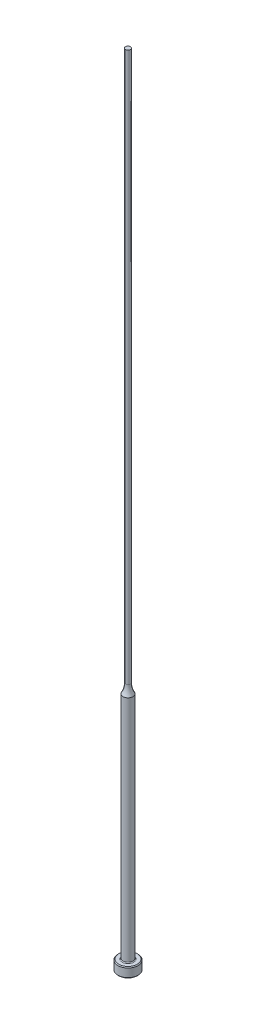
ISO-10303-21;
HEADER;
FILE_DESCRIPTION(('STEP AP214'),'2;1');
FILE_NAME('part.step','',(''),(''),'','','');
FILE_SCHEMA(('AUTOMOTIVE_DESIGN { 1 0 10303 214 1 1 1 1 }'));
ENDSEC;
DATA;
#1=APPLICATION_CONTEXT('core data for automotive mechanical design processes');
#2=APPLICATION_PROTOCOL_DEFINITION('international standard','automotive_design',2000,#1);
#3=PRODUCT_CONTEXT('',#1,'mechanical');
#4=PRODUCT('Part','Part','',(#3));
#5=PRODUCT_RELATED_PRODUCT_CATEGORY('part','',(#4));
#6=PRODUCT_DEFINITION_FORMATION('','',#4);
#7=PRODUCT_DEFINITION_CONTEXT('part definition',#1,'design');
#8=PRODUCT_DEFINITION('design','',#6,#7);
#9=PRODUCT_DEFINITION_SHAPE('','',#8);
#10=(LENGTH_UNIT() NAMED_UNIT(*) SI_UNIT(.MILLI.,.METRE.));
#11=(NAMED_UNIT(*) PLANE_ANGLE_UNIT() SI_UNIT($,.RADIAN.));
#12=(NAMED_UNIT(*) SI_UNIT($,.STERADIAN.) SOLID_ANGLE_UNIT());
#13=UNCERTAINTY_MEASURE_WITH_UNIT(LENGTH_MEASURE(1.E-05),#10,'distance_accuracy_value','');
#14=(GEOMETRIC_REPRESENTATION_CONTEXT(3) GLOBAL_UNCERTAINTY_ASSIGNED_CONTEXT((#13)) GLOBAL_UNIT_ASSIGNED_CONTEXT((#10,
#11,#12)) REPRESENTATION_CONTEXT('',''));
#15=CARTESIAN_POINT('',(0.,0.,0.));
#16=DIRECTION('',(0.,0.,1.));
#17=DIRECTION('',(1.,0.,0.));
#18=AXIS2_PLACEMENT_3D('',#15,#16,#17);
#19=CARTESIAN_POINT('',(-0.793749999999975,254.,0.));
#20=DIRECTION('',(0.,1.,0.));
#21=DIRECTION('',(0.,0.,1.));
#22=AXIS2_PLACEMENT_3D('',#19,#20,#21);
#23=PLANE('',#22);
#24=CARTESIAN_POINT('',(0.,254.,0.));
#25=DIRECTION('',(0.,1.,0.));
#26=DIRECTION('',(0.,0.,1.));
#27=AXIS2_PLACEMENT_3D('',#24,#25,#26);
#28=CIRCLE('',#27,0.793749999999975);
#29=CARTESIAN_POINT('',(0.,254.,0.793749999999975));
#30=VERTEX_POINT('',#29);
#31=EDGE_CURVE('E61',#30,#30,#28,.T.);
#32=ORIENTED_EDGE('',*,*,#31,.T.);
#33=EDGE_LOOP('',(#32));
#34=FACE_BOUND('',#33,.T.);
#35=ADVANCED_FACE('F35',(#34),#23,.T.);
#36=CARTESIAN_POINT('',(0.,259.958771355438,0.));
#37=DIRECTION('',(0.,1.,0.));
#38=DIRECTION('',(0.,0.,1.));
#39=AXIS2_PLACEMENT_3D('',#36,#37,#38);
#40=CYLINDRICAL_SURFACE('',#39,0.793749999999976);
#41=CARTESIAN_POINT('',(0.,79.2741805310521,0.));
#42=DIRECTION('',(0.,1.,0.));
#43=DIRECTION('',(0.,0.,1.));
#44=AXIS2_PLACEMENT_3D('',#41,#42,#43);
#45=CIRCLE('',#44,0.793749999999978);
#46=CARTESIAN_POINT('',(0.,79.2741805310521,0.793749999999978));
#47=VERTEX_POINT('',#46);
#48=EDGE_CURVE('E64',#47,#47,#45,.T.);
#49=ORIENTED_EDGE('',*,*,#48,.T.);
#50=EDGE_LOOP('',(#49));
#51=FACE_BOUND('',#50,.T.);
#52=ORIENTED_EDGE('',*,*,#31,.F.);
#53=EDGE_LOOP('',(#52));
#54=FACE_BOUND('',#53,.T.);
#55=ADVANCED_FACE('F84',(#51,#54),#40,.T.);
#56=CARTESIAN_POINT('',(0.,79.2741805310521,0.));
#57=DIRECTION('',(0.,1.,0.));
#58=DIRECTION('',(0.,0.,1.));
#59=AXIS2_PLACEMENT_3D('',#56,#57,#58);
#60=TOROIDAL_SURFACE('',#59,7.14374999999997,6.35);
#61=CARTESIAN_POINT('',(0.,76.2,0.));
#62=DIRECTION('',(0.,1.,0.));
#63=DIRECTION('',(0.,0.,1.));
#64=AXIS2_PLACEMENT_3D('',#61,#62,#63);
#65=CIRCLE('',#64,1.58749999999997);
#66=CARTESIAN_POINT('',(0.,76.2,1.58749999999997));
#67=VERTEX_POINT('',#66);
#68=EDGE_CURVE('E67',#67,#67,#65,.T.);
#69=ORIENTED_EDGE('',*,*,#68,.T.);
#70=EDGE_LOOP('',(#69));
#71=FACE_BOUND('',#70,.T.);
#72=ORIENTED_EDGE('',*,*,#48,.F.);
#73=EDGE_LOOP('',(#72));
#74=FACE_BOUND('',#73,.T.);
#75=ADVANCED_FACE('F71',(#71,#74),#60,.F.);
#76=CARTESIAN_POINT('',(0.,259.958771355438,0.));
#77=DIRECTION('',(0.,1.,0.));
#78=DIRECTION('',(0.,0.,1.));
#79=AXIS2_PLACEMENT_3D('',#76,#77,#78);
#80=CYLINDRICAL_SURFACE('',#79,1.58749999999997);
#81=CARTESIAN_POINT('',(0.,3.42900000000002,0.));
#82=DIRECTION('',(0.,1.,0.));
#83=DIRECTION('',(0.,0.,1.));
#84=AXIS2_PLACEMENT_3D('',#81,#82,#83);
#85=CIRCLE('',#84,1.58749999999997);
#86=CARTESIAN_POINT('',(0.,3.42900000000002,1.58749999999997));
#87=VERTEX_POINT('',#86);
#88=EDGE_CURVE('E42',#87,#87,#85,.T.);
#89=ORIENTED_EDGE('',*,*,#88,.T.);
#90=EDGE_LOOP('',(#89));
#91=FACE_BOUND('',#90,.T.);
#92=ORIENTED_EDGE('',*,*,#68,.F.);
#93=EDGE_LOOP('',(#92));
#94=FACE_BOUND('',#93,.T.);
#95=ADVANCED_FACE('F74',(#91,#94),#80,.T.);
#96=CARTESIAN_POINT('',(-3.17499999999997,3.175,0.));
#97=DIRECTION('',(0.,1.,0.));
#98=DIRECTION('',(0.,0.,1.));
#99=AXIS2_PLACEMENT_3D('',#96,#97,#98);
#100=PLANE('',#99);
#101=CARTESIAN_POINT('',(0.,3.175,0.));
#102=DIRECTION('',(0.,1.,0.));
#103=DIRECTION('',(0.,0.,1.));
#104=AXIS2_PLACEMENT_3D('',#101,#102,#103);
#105=CIRCLE('',#104,1.84149999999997);
#106=CARTESIAN_POINT('',(0.,3.175,1.84149999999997));
#107=VERTEX_POINT('',#106);
#108=EDGE_CURVE('E10',#107,#107,#105,.F.);
#109=ORIENTED_EDGE('',*,*,#108,.T.);
#110=EDGE_LOOP('',(#109));
#111=FACE_BOUND('',#110,.T.);
#112=CARTESIAN_POINT('',(0.,3.175,0.));
#113=DIRECTION('',(0.,1.,0.));
#114=DIRECTION('',(0.,0.,1.));
#115=AXIS2_PLACEMENT_3D('',#112,#113,#114);
#116=CIRCLE('',#115,2.92099999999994);
#117=CARTESIAN_POINT('',(0.,3.175,2.92099999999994));
#118=VERTEX_POINT('',#117);
#119=EDGE_CURVE('E58',#118,#118,#116,.T.);
#120=ORIENTED_EDGE('',*,*,#119,.T.);
#121=EDGE_LOOP('',(#120));
#122=FACE_BOUND('',#121,.T.);
#123=ADVANCED_FACE('F76',(#111,#122),#100,.T.);
#124=CARTESIAN_POINT('',(0.,259.958771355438,0.));
#125=DIRECTION('',(0.,1.,0.));
#126=DIRECTION('',(0.,0.,1.));
#127=AXIS2_PLACEMENT_3D('',#124,#125,#126);
#128=CYLINDRICAL_SURFACE('',#127,3.17499999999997);
#129=CARTESIAN_POINT('',(0.,2.92100000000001,0.));
#130=DIRECTION('',(0.,1.,0.));
#131=DIRECTION('',(0.,0.,1.));
#132=AXIS2_PLACEMENT_3D('',#129,#130,#131);
#133=CIRCLE('',#132,3.17499999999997);
#134=CARTESIAN_POINT('',(0.,2.92100000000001,3.17499999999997));
#135=VERTEX_POINT('',#134);
#136=EDGE_CURVE('E50',#135,#135,#133,.F.);
#137=ORIENTED_EDGE('',*,*,#136,.T.);
#138=EDGE_LOOP('',(#137));
#139=FACE_BOUND('',#138,.T.);
#140=CARTESIAN_POINT('',(0.,0.253999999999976,0.));
#141=DIRECTION('',(0.,-1.,0.));
#142=DIRECTION('',(0.,0.,-1.));
#143=AXIS2_PLACEMENT_3D('',#140,#141,#142);
#144=CIRCLE('',#143,3.17499999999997);
#145=CARTESIAN_POINT('',(0.,0.253999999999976,-3.17499999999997));
#146=VERTEX_POINT('',#145);
#147=EDGE_CURVE('E55',#146,#146,#144,.F.);
#148=ORIENTED_EDGE('',*,*,#147,.T.);
#149=EDGE_LOOP('',(#148));
#150=FACE_BOUND('',#149,.T.);
#151=ADVANCED_FACE('F82',(#139,#150),#128,.T.);
#152=CARTESIAN_POINT('',(0.,0.,0.));
#153=DIRECTION('',(0.,-1.,0.));
#154=DIRECTION('',(0.,0.,-1.));
#155=AXIS2_PLACEMENT_3D('',#152,#153,#154);
#156=PLANE('',#155);
#157=CARTESIAN_POINT('',(0.,0.,0.));
#158=DIRECTION('',(0.,-1.,0.));
#159=DIRECTION('',(0.,0.,-1.));
#160=AXIS2_PLACEMENT_3D('',#157,#158,#159);
#161=CIRCLE('',#160,2.92100000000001);
#162=CARTESIAN_POINT('',(0.,0.,-2.92100000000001));
#163=VERTEX_POINT('',#162);
#164=EDGE_CURVE('E46',#163,#163,#161,.T.);
#165=ORIENTED_EDGE('',*,*,#164,.T.);
#166=EDGE_LOOP('',(#165));
#167=FACE_BOUND('',#166,.T.);
#168=ADVANCED_FACE('F98',(#167),#156,.T.);
#169=CARTESIAN_POINT('',(0.,3.17499999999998,0.));
#170=DIRECTION('',(0.,-1.,0.));
#171=DIRECTION('',(0.,0.,-1.));
#172=AXIS2_PLACEMENT_3D('',#169,#170,#171);
#173=CONICAL_SURFACE('',#172,2.92099999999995,0.785398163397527);
#174=ORIENTED_EDGE('',*,*,#136,.F.);
#175=EDGE_LOOP('',(#174));
#176=FACE_BOUND('',#175,.T.);
#177=ORIENTED_EDGE('',*,*,#119,.F.);
#178=EDGE_LOOP('',(#177));
#179=FACE_BOUND('',#178,.T.);
#180=ADVANCED_FACE('F95',(#176,#179),#173,.T.);
#181=CARTESIAN_POINT('',(0.,0.253999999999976,0.));
#182=DIRECTION('',(0.,1.,0.));
#183=DIRECTION('',(0.,0.,1.));
#184=AXIS2_PLACEMENT_3D('',#181,#182,#183);
#185=CONICAL_SURFACE('',#184,3.17499999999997,0.785398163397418);
#186=ORIENTED_EDGE('',*,*,#164,.F.);
#187=EDGE_LOOP('',(#186));
#188=FACE_BOUND('',#187,.T.);
#189=ORIENTED_EDGE('',*,*,#147,.F.);
#190=EDGE_LOOP('',(#189));
#191=FACE_BOUND('',#190,.T.);
#192=ADVANCED_FACE('F97',(#188,#191),#185,.T.);
#193=CARTESIAN_POINT('',(0.,3.42900000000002,0.));
#194=DIRECTION('',(0.,1.,0.));
#195=DIRECTION('',(0.,0.,1.));
#196=AXIS2_PLACEMENT_3D('',#193,#194,#195);
#197=TOROIDAL_SURFACE('',#196,1.84149999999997,0.254);
#198=ORIENTED_EDGE('',*,*,#108,.F.);
#199=EDGE_LOOP('',(#198));
#200=FACE_BOUND('',#199,.T.);
#201=ORIENTED_EDGE('',*,*,#88,.F.);
#202=EDGE_LOOP('',(#201));
#203=FACE_BOUND('',#202,.T.);
#204=ADVANCED_FACE('F37',(#200,#203),#197,.F.);
#205=CLOSED_SHELL('',(#35,#55,#75,#95,#123,#151,#168,#180,#192,#204));
#206=MANIFOLD_SOLID_BREP('B2',#205);
#207=ADVANCED_BREP_SHAPE_REPRESENTATION('',(#18,#206),#14);
#208=SHAPE_DEFINITION_REPRESENTATION(#9,#207);
ENDSEC;
END-ISO-10303-21;
